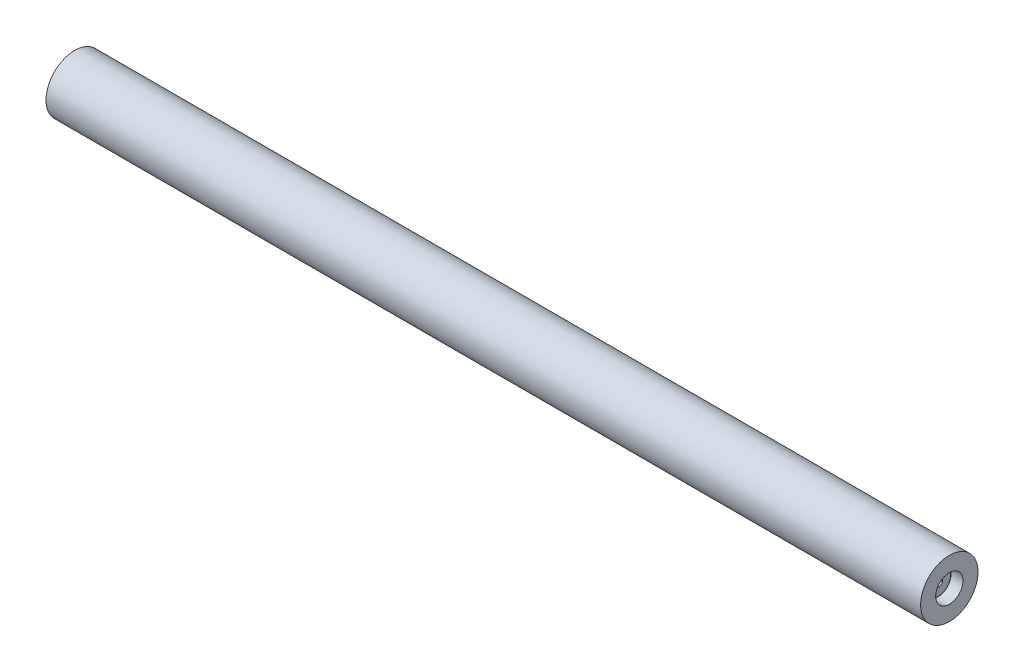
from build123d import *

# Parameters (mm, degrees)
SKETCH1_W          = 381
SKETCH1_H          = 12.5095
SKETCH3_R          = 5.9563
CUT_EXTRUDE1_DEPTH = 9.525
CUT_EXTRUDE2_START = 9.525
SKETCH2_R          = 5.9563
CUT_EXTRUDE2_DEPTH = 9.525
CUT_EXTRUDE3_DEPTH = 2.38125
CUT_EXTRUDE4_DEPTH = 2.38125


with BuildPart() as part:
    # Sketch1 → Revolve1 (revolve)
    with BuildSketch(Plane.XY, mode=Mode.PRIVATE) as revolve1_sk:
        with Locations((190.5, 6.25475)):
            Rectangle(SKETCH1_W, SKETCH1_H)
    revolve(revolve1_sk.sketch.rotate(Axis((381, 0, 0), (-1, 0, 0)), 270), axis=Axis((381, 0, 0), (-1, 0, 0)))

    # Sketch3 → Cut-Extrude1 (cut)
    with BuildSketch(Plane(origin=(381, 0, 0), x_dir=(0, 0, -1), z_dir=(1, 0, 0))):
        Circle(SKETCH3_R)
    extrude(amount=-CUT_EXTRUDE1_DEPTH, mode=Mode.SUBTRACT)

    # Sketch2 → Cut-Extrude2 (cut)
    with BuildSketch(Plane(origin=(0, 0, 0), x_dir=(0, 0, -1), z_dir=(1, 0, 0)).offset(CUT_EXTRUDE2_START)):
        Circle(SKETCH2_R)
    extrude(amount=-CUT_EXTRUDE2_DEPTH, mode=Mode.SUBTRACT)

    # Sketch4 → Revolve2 (revolve)
    with BuildSketch(Plane.XY, mode=Mode.PRIVATE) as revolve2_sk:
        with BuildLine():
            Line((4.7625, 0), (4.7625, 5.2578))
            ThreePointArc((4.7625, 5.2578), (4.911289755, 5.617010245), (5.2705, 5.7658))
            Line((5.2705, 5.7658), (9.525, 5.7658))
            Line((9.525, 5.7658), (9.525, 0))
            Line((9.525, 0), (4.7625, 0))
        make_face()
    revolve(revolve2_sk.sketch.rotate(Axis((9.525, 0, 0), (-1, 0, 0)), 270), axis=Axis((9.525, 0, 0), (-1, 0, 0)))

    # Sketch5 → Revolve3 (revolve)
    with BuildSketch(Plane.XY, mode=Mode.PRIVATE) as revolve3_sk:
        with BuildLine():
            Line((371.475, 0), (371.475, 5.7658))
            Line((371.475, 5.7658), (375.7295, 5.7658))
            ThreePointArc((375.7295, 5.7658), (376.088710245, 5.617010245), (376.2375, 5.2578))
            Line((376.2375, 5.2578), (376.2375, 0))
            Line((376.2375, 0), (371.475, 0))
        make_face()
    revolve(revolve3_sk.sketch.rotate(Axis((376.2375, 0, 0), (-1, 0, 0)), 270), axis=Axis((376.2375, 0, 0), (-1, 0, 0)))

    # Sketch7 → Cut-Extrude3 (cut)
    with BuildSketch(Plane(origin=(376.2375, 0, 0), x_dir=(0, 0, -1), z_dir=(1, 0, 0))):
        Polygon((-1.83515, 1.059524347), (-1.83515, -1.059524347), (0, -2.119048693), (1.83515, -1.059524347), (1.83515, 1.059524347), (0, 2.119048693), align=None)
    extrude(amount=-CUT_EXTRUDE3_DEPTH, mode=Mode.SUBTRACT)

    # Sketch6 → Cut-Extrude4 (cut)
    with BuildSketch(Plane(origin=(4.7625, 0, 0), x_dir=(0, 0, -1), z_dir=(1, 0, 0))):
        Polygon((-1.83515, 1.059524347), (-1.83515, -1.059524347), (0, -2.119048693), (1.83515, -1.059524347), (1.83515, 1.059524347), (0, 2.119048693), align=None)
    extrude(amount=CUT_EXTRUDE4_DEPTH, mode=Mode.SUBTRACT)


solid = part.part
